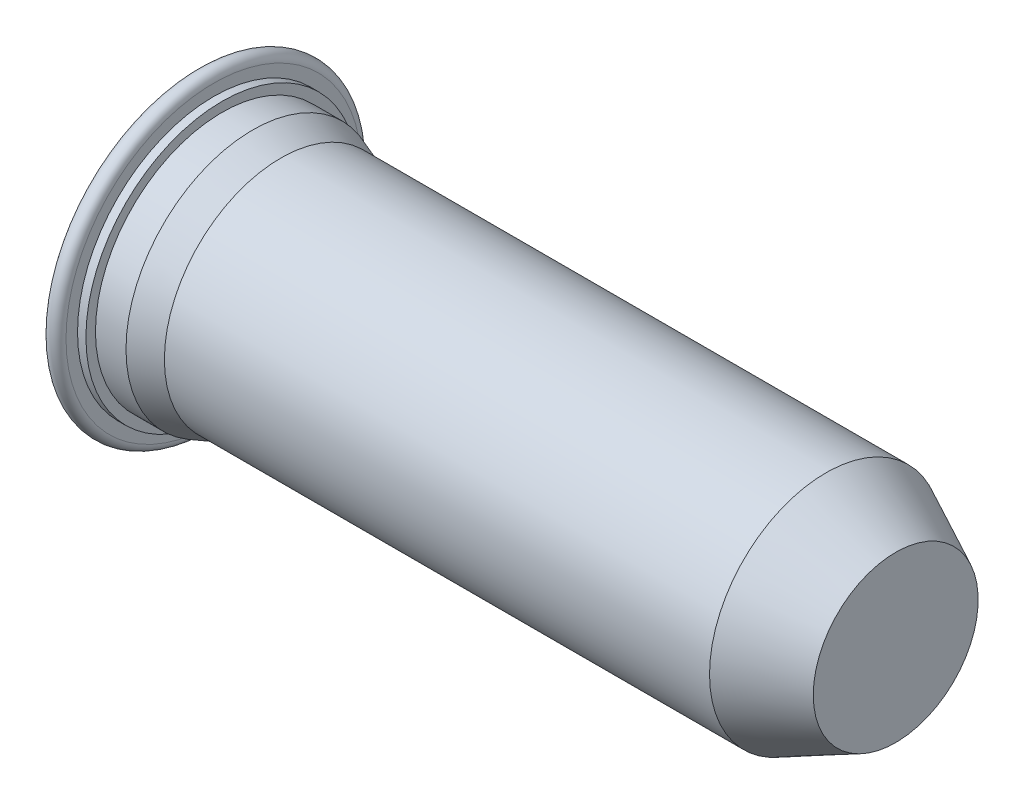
from build123d import *


with BuildPart() as part:
    # BodySke → BaseBody (revolve)
    with BuildSketch(Plane.XY, mode=Mode.PRIVATE) as basebody_sk:
        with BuildLine():
            Line((0, 0), (0, 4.02336))
            Line((0, 4.02336), (0.00508, 4.02336))
            Line((0.00508, 4.02336), (0.00508, 4.02844))
            ThreePointArc((0.00508, 4.02844), (0.23114, 4.2545), (0.4572, 4.02844))
            Line((0.4572, 4.02844), (0.4572, 3.71475))
            Line((0.4572, 3.71475), (0.6858, 3.71475))
            Line((0.6858, 3.71475), (0.6858, 3.4544))
            Line((0.6858, 3.4544), (1.518354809, 3.4544))
            Line((1.518354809, 3.4544), (2.286, 3.175))
            Line((2.286, 3.175), (17.149163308, 3.175))
            Line((17.149163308, 3.175), (19.05, 2.2479))
            Line((19.05, 2.2479), (19.05, 0))
            Line((19.05, 0), (0, 0))
        make_face()
    revolve(basebody_sk.sketch.rotate(Axis((0, 0, 0), (1, 0, 0)), 90), axis=Axis((0, 0, 0), (1, 0, 0)))


solid = part.part
